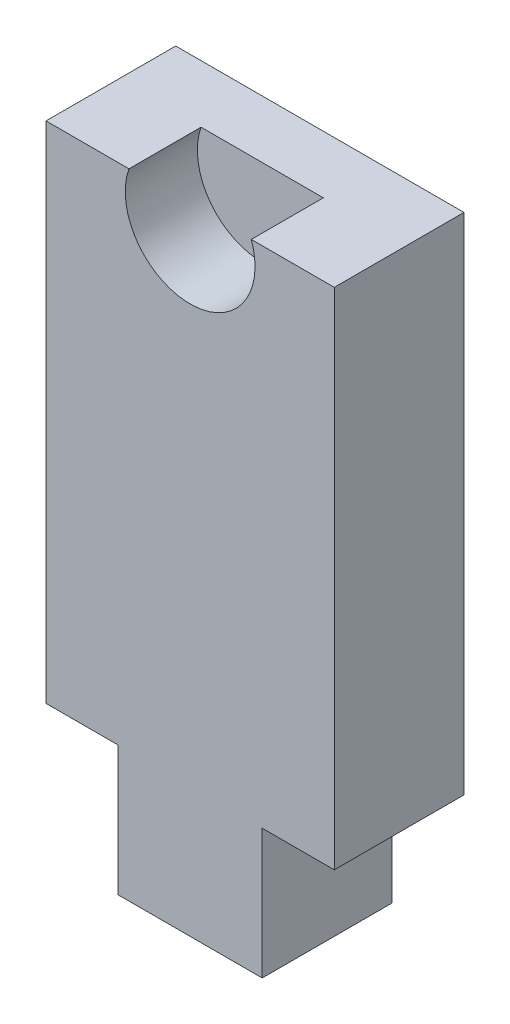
ISO-10303-21;
HEADER;
FILE_DESCRIPTION(('STEP AP214'),'2;1');
FILE_NAME('part.step','',(''),(''),'','','');
FILE_SCHEMA(('AUTOMOTIVE_DESIGN { 1 0 10303 214 1 1 1 1 }'));
ENDSEC;
DATA;
#1=APPLICATION_CONTEXT('core data for automotive mechanical design processes');
#2=APPLICATION_PROTOCOL_DEFINITION('international standard','automotive_design',2000,#1);
#3=PRODUCT_CONTEXT('',#1,'mechanical');
#4=PRODUCT('Part','Part','',(#3));
#5=PRODUCT_RELATED_PRODUCT_CATEGORY('part','',(#4));
#6=PRODUCT_DEFINITION_FORMATION('','',#4);
#7=PRODUCT_DEFINITION_CONTEXT('part definition',#1,'design');
#8=PRODUCT_DEFINITION('design','',#6,#7);
#9=PRODUCT_DEFINITION_SHAPE('','',#8);
#10=(LENGTH_UNIT() NAMED_UNIT(*) SI_UNIT(.MILLI.,.METRE.));
#11=(NAMED_UNIT(*) PLANE_ANGLE_UNIT() SI_UNIT($,.RADIAN.));
#12=(NAMED_UNIT(*) SI_UNIT($,.STERADIAN.) SOLID_ANGLE_UNIT());
#13=UNCERTAINTY_MEASURE_WITH_UNIT(LENGTH_MEASURE(1.E-05),#10,'distance_accuracy_value','');
#14=(GEOMETRIC_REPRESENTATION_CONTEXT(3) GLOBAL_UNCERTAINTY_ASSIGNED_CONTEXT((#13)) GLOBAL_UNIT_ASSIGNED_CONTEXT((#10,
#11,#12)) REPRESENTATION_CONTEXT('',''));
#15=CARTESIAN_POINT('',(0.,0.,0.));
#16=DIRECTION('',(0.,0.,1.));
#17=DIRECTION('',(1.,0.,0.));
#18=AXIS2_PLACEMENT_3D('',#15,#16,#17);
#19=CARTESIAN_POINT('',(-20.,-35.,18.));
#20=DIRECTION('',(0.,1.,0.));
#21=DIRECTION('',(0.,0.,1.));
#22=AXIS2_PLACEMENT_3D('',#19,#20,#21);
#23=PLANE('',#22);
#24=DIRECTION('',(0.,0.,1.));
#25=VECTOR('',#24,1.);
#26=CARTESIAN_POINT('',(10.,-35.,0.));
#27=LINE('',#26,#25);
#28=CARTESIAN_POINT('',(10.,-35.,0.));
#29=VERTEX_POINT('',#28);
#30=CARTESIAN_POINT('',(10.,-35.,18.));
#31=VERTEX_POINT('',#30);
#32=EDGE_CURVE('E142',#29,#31,#27,.T.);
#33=ORIENTED_EDGE('',*,*,#32,.F.);
#34=DIRECTION('',(1.,0.,0.));
#35=VECTOR('',#34,1.);
#36=CARTESIAN_POINT('',(-20.,-35.,0.));
#37=LINE('',#36,#35);
#38=CARTESIAN_POINT('',(20.,-35.,0.));
#39=VERTEX_POINT('',#38);
#40=EDGE_CURVE('E173',#29,#39,#37,.T.);
#41=ORIENTED_EDGE('',*,*,#40,.T.);
#42=DIRECTION('',(0.,0.,-1.));
#43=VECTOR('',#42,1.);
#44=CARTESIAN_POINT('',(20.,-35.,18.));
#45=LINE('',#44,#43);
#46=CARTESIAN_POINT('',(20.,-35.,18.));
#47=VERTEX_POINT('',#46);
#48=EDGE_CURVE('E166',#47,#39,#45,.T.);
#49=ORIENTED_EDGE('',*,*,#48,.F.);
#50=DIRECTION('',(1.,0.,0.));
#51=VECTOR('',#50,1.);
#52=CARTESIAN_POINT('',(-20.,-35.,18.));
#53=LINE('',#52,#51);
#54=EDGE_CURVE('E162',#31,#47,#53,.T.);
#55=ORIENTED_EDGE('',*,*,#54,.F.);
#56=EDGE_LOOP('',(#33,#41,#49,#55));
#57=FACE_BOUND('',#56,.T.);
#58=ADVANCED_FACE('F33',(#57),#23,.F.);
#59=CARTESIAN_POINT('',(20.,-35.,18.));
#60=DIRECTION('',(-1.,0.,0.));
#61=DIRECTION('',(0.,0.,1.));
#62=AXIS2_PLACEMENT_3D('',#59,#60,#61);
#63=PLANE('',#62);
#64=DIRECTION('',(0.,1.,0.));
#65=VECTOR('',#64,1.);
#66=CARTESIAN_POINT('',(20.,-35.,0.));
#67=LINE('',#66,#65);
#68=CARTESIAN_POINT('',(20.,35.,0.));
#69=VERTEX_POINT('',#68);
#70=EDGE_CURVE('E151',#39,#69,#67,.T.);
#71=ORIENTED_EDGE('',*,*,#70,.T.);
#72=DIRECTION('',(0.,0.,-1.));
#73=VECTOR('',#72,1.);
#74=CARTESIAN_POINT('',(20.,35.,18.));
#75=LINE('',#74,#73);
#76=CARTESIAN_POINT('',(20.,35.,18.));
#77=VERTEX_POINT('',#76);
#78=EDGE_CURVE('E183',#77,#69,#75,.T.);
#79=ORIENTED_EDGE('',*,*,#78,.F.);
#80=DIRECTION('',(0.,1.,0.));
#81=VECTOR('',#80,1.);
#82=CARTESIAN_POINT('',(20.,-35.,18.));
#83=LINE('',#82,#81);
#84=EDGE_CURVE('E152',#47,#77,#83,.T.);
#85=ORIENTED_EDGE('',*,*,#84,.F.);
#86=ORIENTED_EDGE('',*,*,#48,.T.);
#87=EDGE_LOOP('',(#71,#79,#85,#86));
#88=FACE_BOUND('',#87,.T.);
#89=ADVANCED_FACE('F35',(#88),#63,.F.);
#90=CARTESIAN_POINT('',(-20.,35.,18.));
#91=DIRECTION('',(0.,-1.,0.));
#92=DIRECTION('',(0.,0.,-1.));
#93=AXIS2_PLACEMENT_3D('',#90,#91,#92);
#94=PLANE('',#93);
#95=DIRECTION('',(-1.,0.,0.));
#96=VECTOR('',#95,1.);
#97=CARTESIAN_POINT('',(-20.,35.,8.));
#98=LINE('',#97,#96);
#99=CARTESIAN_POINT('',(8.48603724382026,35.,8.));
#100=VERTEX_POINT('',#99);
#101=CARTESIAN_POINT('',(-8.48603724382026,35.,8.));
#102=VERTEX_POINT('',#101);
#103=EDGE_CURVE('E11',#100,#102,#98,.T.);
#104=ORIENTED_EDGE('',*,*,#103,.F.);
#105=DIRECTION('',(0.,0.,1.));
#106=VECTOR('',#105,1.);
#107=CARTESIAN_POINT('',(8.48603724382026,35.,8.));
#108=LINE('',#107,#106);
#109=CARTESIAN_POINT('',(8.48603724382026,35.,18.));
#110=VERTEX_POINT('',#109);
#111=EDGE_CURVE('E148',#100,#110,#108,.T.);
#112=ORIENTED_EDGE('',*,*,#111,.T.);
#113=DIRECTION('',(-1.,0.,0.));
#114=VECTOR('',#113,1.);
#115=CARTESIAN_POINT('',(-20.,35.,18.));
#116=LINE('',#115,#114);
#117=EDGE_CURVE('E157',#77,#110,#116,.T.);
#118=ORIENTED_EDGE('',*,*,#117,.F.);
#119=ORIENTED_EDGE('',*,*,#78,.T.);
#120=DIRECTION('',(-1.,0.,0.));
#121=VECTOR('',#120,1.);
#122=CARTESIAN_POINT('',(-20.,35.,0.));
#123=LINE('',#122,#121);
#124=CARTESIAN_POINT('',(-20.,35.,0.));
#125=VERTEX_POINT('',#124);
#126=EDGE_CURVE('E169',#69,#125,#123,.T.);
#127=ORIENTED_EDGE('',*,*,#126,.T.);
#128=DIRECTION('',(0.,0.,-1.));
#129=VECTOR('',#128,1.);
#130=CARTESIAN_POINT('',(-20.,35.,18.));
#131=LINE('',#130,#129);
#132=CARTESIAN_POINT('',(-20.,35.,18.));
#133=VERTEX_POINT('',#132);
#134=EDGE_CURVE('E180',#133,#125,#131,.T.);
#135=ORIENTED_EDGE('',*,*,#134,.F.);
#136=CARTESIAN_POINT('',(-8.48603724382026,35.,18.));
#137=VERTEX_POINT('',#136);
#138=EDGE_CURVE('E155',#137,#133,#116,.T.);
#139=ORIENTED_EDGE('',*,*,#138,.F.);
#140=DIRECTION('',(0.,0.,1.));
#141=VECTOR('',#140,1.);
#142=CARTESIAN_POINT('',(-8.48603724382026,35.,8.));
#143=LINE('',#142,#141);
#144=EDGE_CURVE('E56',#137,#102,#143,.F.);
#145=ORIENTED_EDGE('',*,*,#144,.T.);
#146=EDGE_LOOP('',(#104,#112,#118,#119,#127,#135,#139,#145));
#147=FACE_BOUND('',#146,.T.);
#148=ADVANCED_FACE('F191',(#147),#94,.F.);
#149=CARTESIAN_POINT('',(-20.,-35.,18.));
#150=DIRECTION('',(1.,0.,0.));
#151=DIRECTION('',(0.,0.,-1.));
#152=AXIS2_PLACEMENT_3D('',#149,#150,#151);
#153=PLANE('',#152);
#154=DIRECTION('',(0.,-1.,0.));
#155=VECTOR('',#154,1.);
#156=CARTESIAN_POINT('',(-20.,-35.,0.));
#157=LINE('',#156,#155);
#158=CARTESIAN_POINT('',(-20.,-35.,0.));
#159=VERTEX_POINT('',#158);
#160=EDGE_CURVE('E171',#125,#159,#157,.T.);
#161=ORIENTED_EDGE('',*,*,#160,.T.);
#162=DIRECTION('',(0.,0.,-1.));
#163=VECTOR('',#162,1.);
#164=CARTESIAN_POINT('',(-20.,-35.,18.));
#165=LINE('',#164,#163);
#166=CARTESIAN_POINT('',(-20.,-35.,18.));
#167=VERTEX_POINT('',#166);
#168=EDGE_CURVE('E177',#167,#159,#165,.T.);
#169=ORIENTED_EDGE('',*,*,#168,.F.);
#170=DIRECTION('',(0.,-1.,0.));
#171=VECTOR('',#170,1.);
#172=CARTESIAN_POINT('',(-20.,-35.,18.));
#173=LINE('',#172,#171);
#174=EDGE_CURVE('E160',#133,#167,#173,.T.);
#175=ORIENTED_EDGE('',*,*,#174,.F.);
#176=ORIENTED_EDGE('',*,*,#134,.T.);
#177=EDGE_LOOP('',(#161,#169,#175,#176));
#178=FACE_BOUND('',#177,.T.);
#179=ADVANCED_FACE('F196',(#178),#153,.F.);
#180=CARTESIAN_POINT('',(-10.,-35.,0.));
#181=VERTEX_POINT('',#180);
#182=EDGE_CURVE('E156',#159,#181,#37,.T.);
#183=ORIENTED_EDGE('',*,*,#182,.T.);
#184=DIRECTION('',(0.,0.,1.));
#185=VECTOR('',#184,1.);
#186=CARTESIAN_POINT('',(-10.,-35.,0.));
#187=LINE('',#186,#185);
#188=CARTESIAN_POINT('',(-10.,-35.,18.));
#189=VERTEX_POINT('',#188);
#190=EDGE_CURVE('E131',#181,#189,#187,.T.);
#191=ORIENTED_EDGE('',*,*,#190,.T.);
#192=EDGE_CURVE('E163',#167,#189,#53,.T.);
#193=ORIENTED_EDGE('',*,*,#192,.F.);
#194=ORIENTED_EDGE('',*,*,#168,.T.);
#195=EDGE_LOOP('',(#183,#191,#193,#194));
#196=FACE_BOUND('',#195,.T.);
#197=ADVANCED_FACE('F199',(#196),#23,.F.);
#198=CARTESIAN_POINT('',(0.,0.,18.));
#199=DIRECTION('',(0.,0.,-1.));
#200=DIRECTION('',(-1.,0.,0.));
#201=AXIS2_PLACEMENT_3D('',#198,#199,#200);
#202=PLANE('',#201);
#203=ORIENTED_EDGE('',*,*,#117,.T.);
#204=CARTESIAN_POINT('',(0.,32.0021387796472,18.));
#205=DIRECTION('',(0.,0.,-1.));
#206=DIRECTION('',(-1.,0.,0.));
#207=AXIS2_PLACEMENT_3D('',#204,#205,#206);
#208=CIRCLE('',#207,9.);
#209=EDGE_CURVE('E41',#110,#137,#208,.T.);
#210=ORIENTED_EDGE('',*,*,#209,.T.);
#211=ORIENTED_EDGE('',*,*,#138,.T.);
#212=ORIENTED_EDGE('',*,*,#174,.T.);
#213=ORIENTED_EDGE('',*,*,#192,.T.);
#214=DIRECTION('',(0.,-1.,0.));
#215=VECTOR('',#214,1.);
#216=CARTESIAN_POINT('',(-10.,-53.,18.));
#217=LINE('',#216,#215);
#218=CARTESIAN_POINT('',(-10.,-53.,18.));
#219=VERTEX_POINT('',#218);
#220=EDGE_CURVE('E48',#189,#219,#217,.T.);
#221=ORIENTED_EDGE('',*,*,#220,.T.);
#222=DIRECTION('',(1.,0.,0.));
#223=VECTOR('',#222,1.);
#224=CARTESIAN_POINT('',(-10.,-53.,18.));
#225=LINE('',#224,#223);
#226=CARTESIAN_POINT('',(10.,-53.,18.));
#227=VERTEX_POINT('',#226);
#228=EDGE_CURVE('E115',#219,#227,#225,.T.);
#229=ORIENTED_EDGE('',*,*,#228,.T.);
#230=DIRECTION('',(0.,1.,0.));
#231=VECTOR('',#230,1.);
#232=CARTESIAN_POINT('',(10.,-53.,18.));
#233=LINE('',#232,#231);
#234=EDGE_CURVE('E132',#227,#31,#233,.T.);
#235=ORIENTED_EDGE('',*,*,#234,.T.);
#236=ORIENTED_EDGE('',*,*,#54,.T.);
#237=ORIENTED_EDGE('',*,*,#84,.T.);
#238=EDGE_LOOP('',(#203,#210,#211,#212,#213,#221,#229,#235,#236,#237));
#239=FACE_BOUND('',#238,.T.);
#240=ADVANCED_FACE('F187',(#239),#202,.F.);
#241=CARTESIAN_POINT('',(0.,0.,0.));
#242=DIRECTION('',(0.,0.,-1.));
#243=DIRECTION('',(-1.,0.,0.));
#244=AXIS2_PLACEMENT_3D('',#241,#242,#243);
#245=PLANE('',#244);
#246=ORIENTED_EDGE('',*,*,#70,.F.);
#247=ORIENTED_EDGE('',*,*,#40,.F.);
#248=DIRECTION('',(0.,1.,0.));
#249=VECTOR('',#248,1.);
#250=CARTESIAN_POINT('',(10.,-53.,0.));
#251=LINE('',#250,#249);
#252=CARTESIAN_POINT('',(10.,-53.,0.));
#253=VERTEX_POINT('',#252);
#254=EDGE_CURVE('E118',#253,#29,#251,.T.);
#255=ORIENTED_EDGE('',*,*,#254,.F.);
#256=DIRECTION('',(1.,0.,0.));
#257=VECTOR('',#256,1.);
#258=CARTESIAN_POINT('',(-10.,-53.,0.));
#259=LINE('',#258,#257);
#260=CARTESIAN_POINT('',(-10.,-53.,0.));
#261=VERTEX_POINT('',#260);
#262=EDGE_CURVE('E113',#261,#253,#259,.T.);
#263=ORIENTED_EDGE('',*,*,#262,.F.);
#264=DIRECTION('',(0.,-1.,0.));
#265=VECTOR('',#264,1.);
#266=CARTESIAN_POINT('',(-10.,-53.,0.));
#267=LINE('',#266,#265);
#268=EDGE_CURVE('E126',#181,#261,#267,.T.);
#269=ORIENTED_EDGE('',*,*,#268,.F.);
#270=ORIENTED_EDGE('',*,*,#182,.F.);
#271=ORIENTED_EDGE('',*,*,#160,.F.);
#272=ORIENTED_EDGE('',*,*,#126,.F.);
#273=EDGE_LOOP('',(#246,#247,#255,#263,#269,#270,#271,#272));
#274=FACE_BOUND('',#273,.T.);
#275=ADVANCED_FACE('F124',(#274),#245,.T.);
#276=CARTESIAN_POINT('',(0.,32.0021387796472,8.));
#277=DIRECTION('',(0.,0.,1.));
#278=DIRECTION('',(1.,0.,0.));
#279=AXIS2_PLACEMENT_3D('',#276,#277,#278);
#280=PLANE('',#279);
#281=ORIENTED_EDGE('',*,*,#103,.T.);
#282=CARTESIAN_POINT('',(0.,32.0021387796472,8.));
#283=DIRECTION('',(0.,0.,1.));
#284=DIRECTION('',(1.,0.,0.));
#285=AXIS2_PLACEMENT_3D('',#282,#283,#284);
#286=CIRCLE('',#285,9.);
#287=EDGE_CURVE('E141',#102,#100,#286,.T.);
#288=ORIENTED_EDGE('',*,*,#287,.T.);
#289=EDGE_LOOP('',(#281,#288));
#290=FACE_BOUND('',#289,.T.);
#291=ADVANCED_FACE('F270',(#290),#280,.T.);
#292=CARTESIAN_POINT('',(0.,32.0021387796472,8.));
#293=DIRECTION('',(0.,0.,1.));
#294=DIRECTION('',(1.,0.,0.));
#295=AXIS2_PLACEMENT_3D('',#292,#293,#294);
#296=CYLINDRICAL_SURFACE('',#295,9.);
#297=ORIENTED_EDGE('',*,*,#287,.F.);
#298=ORIENTED_EDGE('',*,*,#144,.F.);
#299=ORIENTED_EDGE('',*,*,#209,.F.);
#300=ORIENTED_EDGE('',*,*,#111,.F.);
#301=EDGE_LOOP('',(#297,#298,#299,#300));
#302=FACE_BOUND('',#301,.T.);
#303=ADVANCED_FACE('F217',(#302),#296,.F.);
#304=CARTESIAN_POINT('',(-10.,-53.,0.));
#305=DIRECTION('',(-1.,0.,0.));
#306=DIRECTION('',(0.,-1.,0.));
#307=AXIS2_PLACEMENT_3D('',#304,#305,#306);
#308=PLANE('',#307);
#309=ORIENTED_EDGE('',*,*,#220,.F.);
#310=ORIENTED_EDGE('',*,*,#190,.F.);
#311=ORIENTED_EDGE('',*,*,#268,.T.);
#312=DIRECTION('',(0.,0.,1.));
#313=VECTOR('',#312,1.);
#314=CARTESIAN_POINT('',(-10.,-53.,0.));
#315=LINE('',#314,#313);
#316=EDGE_CURVE('E110',#261,#219,#315,.T.);
#317=ORIENTED_EDGE('',*,*,#316,.T.);
#318=EDGE_LOOP('',(#309,#310,#311,#317));
#319=FACE_BOUND('',#318,.T.);
#320=ADVANCED_FACE('F130',(#319),#308,.T.);
#321=CARTESIAN_POINT('',(10.,-53.,0.));
#322=DIRECTION('',(1.,0.,0.));
#323=DIRECTION('',(0.,0.,-1.));
#324=AXIS2_PLACEMENT_3D('',#321,#322,#323);
#325=PLANE('',#324);
#326=ORIENTED_EDGE('',*,*,#234,.F.);
#327=DIRECTION('',(0.,0.,1.));
#328=VECTOR('',#327,1.);
#329=CARTESIAN_POINT('',(10.,-53.,0.));
#330=LINE('',#329,#328);
#331=EDGE_CURVE('E117',#253,#227,#330,.T.);
#332=ORIENTED_EDGE('',*,*,#331,.F.);
#333=ORIENTED_EDGE('',*,*,#254,.T.);
#334=ORIENTED_EDGE('',*,*,#32,.T.);
#335=EDGE_LOOP('',(#326,#332,#333,#334));
#336=FACE_BOUND('',#335,.T.);
#337=ADVANCED_FACE('F209',(#336),#325,.T.);
#338=CARTESIAN_POINT('',(-10.,-53.,0.));
#339=DIRECTION('',(0.,-1.,0.));
#340=DIRECTION('',(0.,0.,-1.));
#341=AXIS2_PLACEMENT_3D('',#338,#339,#340);
#342=PLANE('',#341);
#343=ORIENTED_EDGE('',*,*,#228,.F.);
#344=ORIENTED_EDGE('',*,*,#316,.F.);
#345=ORIENTED_EDGE('',*,*,#262,.T.);
#346=ORIENTED_EDGE('',*,*,#331,.T.);
#347=EDGE_LOOP('',(#343,#344,#345,#346));
#348=FACE_BOUND('',#347,.T.);
#349=ADVANCED_FACE('F112',(#348),#342,.T.);
#350=CLOSED_SHELL('',(#58,#89,#148,#179,#197,#240,#275,#291,#303,#320,#337,#349));
#351=MANIFOLD_SOLID_BREP('B2',#350);
#352=ADVANCED_BREP_SHAPE_REPRESENTATION('',(#18,#351),#14);
#353=SHAPE_DEFINITION_REPRESENTATION(#9,#352);
ENDSEC;
END-ISO-10303-21;
